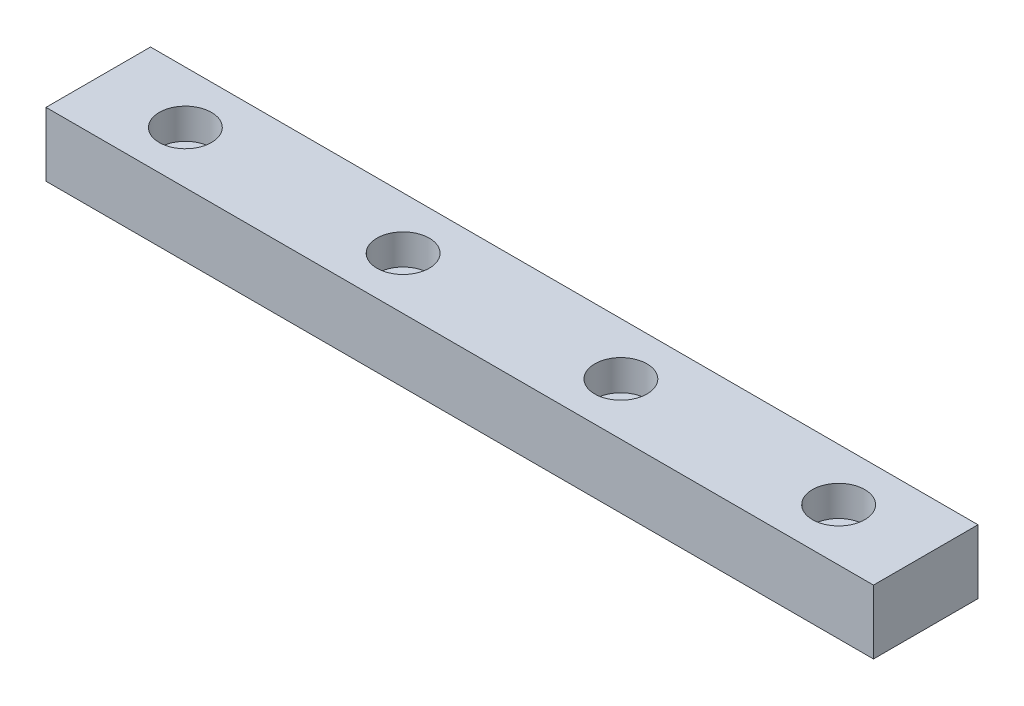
from build123d import *

# Parameters (mm, degrees)
SKETCH_1_W          = 95
SKETCH_1_H          = 7.35
EXTRUDE_1_DEPTH     = 12
SKETCH_2_R          = 1.75
CUT_EXTRUDE_1_DEPTH = 12
SKETCH_3_R          = 3
CUT_EXTRUDE_2_DEPTH = 3.5


with BuildPart() as part:
    # Sketch 1 → Extrude 1 (new body)
    with BuildSketch(Plane.XY):
        with Locations((47.5, 3.675)):
            Rectangle(SKETCH_1_W, SKETCH_1_H)
    extrude(amount=EXTRUDE_1_DEPTH)

    # Sketch 2 → Cut-Extrude 1 (cut)
    with BuildSketch(Plane(origin=(0, 7.35, 0), x_dir=(1, 0, 0), z_dir=(0, 1, 0))):
        with Locations(Location((60, -6, 0), (0, 0, 270))):
            Circle(SKETCH_2_R)
        with Locations(Location((35, -6, 0), (0, 0, 270))):
            Circle(SKETCH_2_R)
        with Locations(Location((10, -6, 0), (0, 0, 270))):
            Circle(SKETCH_2_R)
        with Locations(Location((85, -6, 0), (0, 0, 270))):
            Circle(SKETCH_2_R)
    extrude(amount=-CUT_EXTRUDE_1_DEPTH, mode=Mode.SUBTRACT)

    # Sketch 3 → Cut-Extrude 2 (cut)
    with BuildSketch(Plane(origin=(0, 7.35, 0), x_dir=(1, 0, 0), z_dir=(0, 1, 0))):
        with Locations(Location((60, -6, 0), (0, 0, 270))):
            Circle(SKETCH_3_R)
        with Locations(Location((35, -6, 0), (0, 0, 270))):
            Circle(SKETCH_3_R)
        with Locations(Location((10, -6, 0), (0, 0, 270))):
            Circle(SKETCH_3_R)
        with Locations(Location((85, -6, 0), (0, 0, 270))):
            Circle(SKETCH_3_R)
    extrude(amount=-CUT_EXTRUDE_2_DEPTH, mode=Mode.SUBTRACT)


solid = part.part
